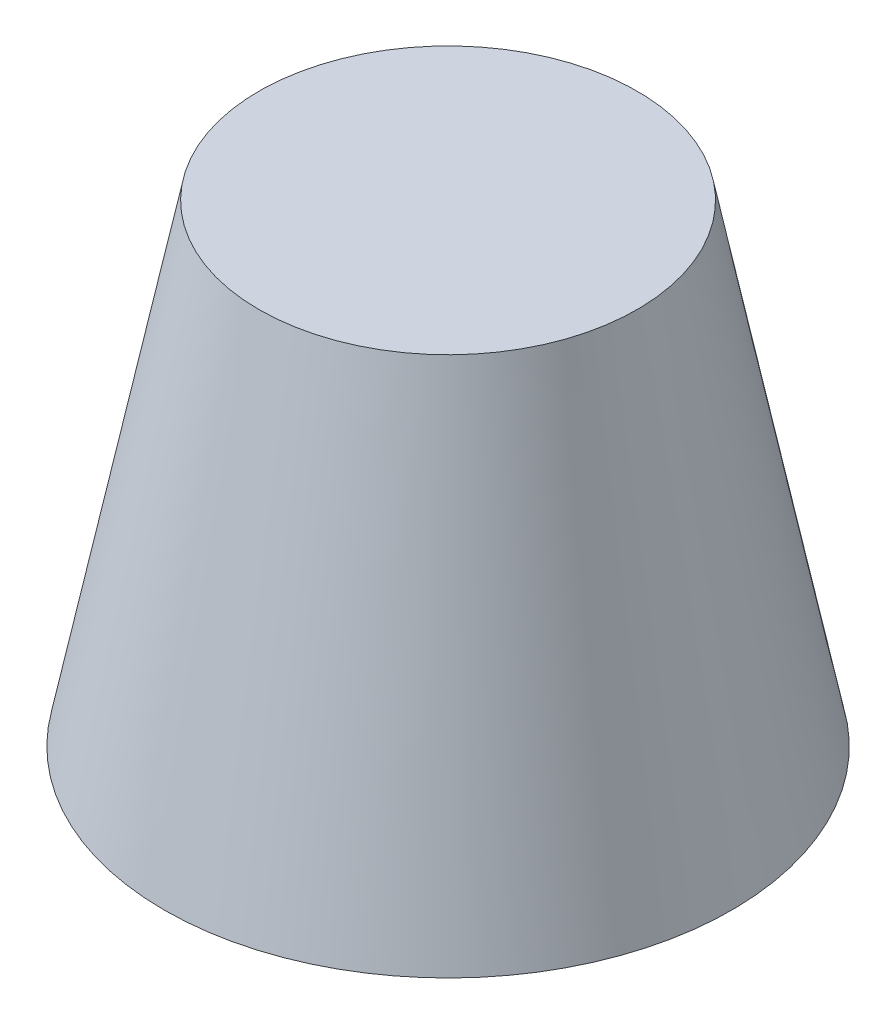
ISO-10303-21;
HEADER;
FILE_DESCRIPTION(('STEP AP214'),'2;1');
FILE_NAME('part.step','',(''),(''),'','','');
FILE_SCHEMA(('AUTOMOTIVE_DESIGN { 1 0 10303 214 1 1 1 1 }'));
ENDSEC;
DATA;
#1=APPLICATION_CONTEXT('core data for automotive mechanical design processes');
#2=APPLICATION_PROTOCOL_DEFINITION('international standard','automotive_design',2000,#1);
#3=PRODUCT_CONTEXT('',#1,'mechanical');
#4=PRODUCT('Part','Part','',(#3));
#5=PRODUCT_RELATED_PRODUCT_CATEGORY('part','',(#4));
#6=PRODUCT_DEFINITION_FORMATION('','',#4);
#7=PRODUCT_DEFINITION_CONTEXT('part definition',#1,'design');
#8=PRODUCT_DEFINITION('design','',#6,#7);
#9=PRODUCT_DEFINITION_SHAPE('','',#8);
#10=(LENGTH_UNIT() NAMED_UNIT(*) SI_UNIT(.MILLI.,.METRE.));
#11=(NAMED_UNIT(*) PLANE_ANGLE_UNIT() SI_UNIT($,.RADIAN.));
#12=(NAMED_UNIT(*) SI_UNIT($,.STERADIAN.) SOLID_ANGLE_UNIT());
#13=UNCERTAINTY_MEASURE_WITH_UNIT(LENGTH_MEASURE(1.E-05),#10,'distance_accuracy_value','');
#14=(GEOMETRIC_REPRESENTATION_CONTEXT(3) GLOBAL_UNCERTAINTY_ASSIGNED_CONTEXT((#13)) GLOBAL_UNIT_ASSIGNED_CONTEXT((#10,
#11,#12)) REPRESENTATION_CONTEXT('',''));
#15=CARTESIAN_POINT('',(0.,0.,0.));
#16=DIRECTION('',(0.,0.,1.));
#17=DIRECTION('',(1.,0.,0.));
#18=AXIS2_PLACEMENT_3D('',#15,#16,#17);
#19=CARTESIAN_POINT('',(4.00000000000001,9.99999999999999,0.));
#20=DIRECTION('',(0.,-1.,0.));
#21=DIRECTION('',(0.,0.,-1.));
#22=AXIS2_PLACEMENT_3D('',#19,#20,#21);
#23=PLANE('',#22);
#24=CARTESIAN_POINT('',(0.,9.99999999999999,0.));
#25=DIRECTION('',(0.,1.,0.));
#26=DIRECTION('',(0.,0.,1.));
#27=AXIS2_PLACEMENT_3D('',#24,#25,#26);
#28=CIRCLE('',#27,4.00000000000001);
#29=CARTESIAN_POINT('',(0.,9.99999999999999,4.00000000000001));
#30=VERTEX_POINT('',#29);
#31=EDGE_CURVE('E10',#30,#30,#28,.T.);
#32=ORIENTED_EDGE('',*,*,#31,.T.);
#33=EDGE_LOOP('',(#32));
#34=FACE_BOUND('',#33,.T.);
#35=ADVANCED_FACE('F20',(#34),#23,.F.);
#36=CARTESIAN_POINT('',(0.,0.,0.));
#37=DIRECTION('',(0.,-1.,0.));
#38=DIRECTION('',(0.,0.,-1.));
#39=AXIS2_PLACEMENT_3D('',#36,#37,#38);
#40=CONICAL_SURFACE('',#39,6.,0.19739555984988);
#41=ORIENTED_EDGE('',*,*,#31,.F.);
#42=EDGE_LOOP('',(#41));
#43=FACE_BOUND('',#42,.T.);
#44=CARTESIAN_POINT('',(0.,0.,0.));
#45=DIRECTION('',(0.,1.,0.));
#46=DIRECTION('',(0.,0.,1.));
#47=AXIS2_PLACEMENT_3D('',#44,#45,#46);
#48=CIRCLE('',#47,6.);
#49=CARTESIAN_POINT('',(0.,0.,6.));
#50=VERTEX_POINT('',#49);
#51=EDGE_CURVE('E26',#50,#50,#48,.T.);
#52=ORIENTED_EDGE('',*,*,#51,.T.);
#53=EDGE_LOOP('',(#52));
#54=FACE_BOUND('',#53,.T.);
#55=ADVANCED_FACE('F32',(#43,#54),#40,.T.);
#56=CARTESIAN_POINT('',(0.,0.,0.));
#57=DIRECTION('',(0.,1.,0.));
#58=DIRECTION('',(0.,0.,1.));
#59=AXIS2_PLACEMENT_3D('',#56,#57,#58);
#60=PLANE('',#59);
#61=ORIENTED_EDGE('',*,*,#51,.F.);
#62=EDGE_LOOP('',(#61));
#63=FACE_BOUND('',#62,.T.);
#64=ADVANCED_FACE('F34',(#63),#60,.F.);
#65=CLOSED_SHELL('',(#35,#55,#64));
#66=MANIFOLD_SOLID_BREP('B2',#65);
#67=ADVANCED_BREP_SHAPE_REPRESENTATION('',(#18,#66),#14);
#68=SHAPE_DEFINITION_REPRESENTATION(#9,#67);
ENDSEC;
END-ISO-10303-21;
